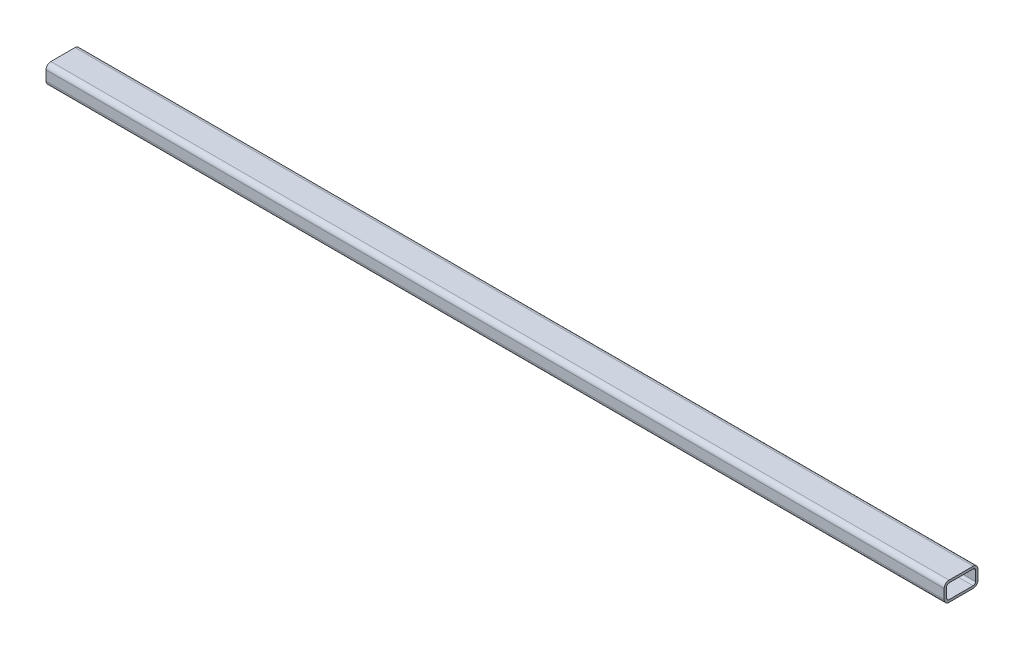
ISO-10303-21;
HEADER;
FILE_DESCRIPTION(('STEP AP214'),'2;1');
FILE_NAME('part.step','',(''),(''),'','','');
FILE_SCHEMA(('AUTOMOTIVE_DESIGN { 1 0 10303 214 1 1 1 1 }'));
ENDSEC;
DATA;
#1=APPLICATION_CONTEXT('core data for automotive mechanical design processes');
#2=APPLICATION_PROTOCOL_DEFINITION('international standard','automotive_design',2000,#1);
#3=PRODUCT_CONTEXT('',#1,'mechanical');
#4=PRODUCT('Part','Part','',(#3));
#5=PRODUCT_RELATED_PRODUCT_CATEGORY('part','',(#4));
#6=PRODUCT_DEFINITION_FORMATION('','',#4);
#7=PRODUCT_DEFINITION_CONTEXT('part definition',#1,'design');
#8=PRODUCT_DEFINITION('design','',#6,#7);
#9=PRODUCT_DEFINITION_SHAPE('','',#8);
#10=(LENGTH_UNIT() NAMED_UNIT(*) SI_UNIT(.MILLI.,.METRE.));
#11=(NAMED_UNIT(*) PLANE_ANGLE_UNIT() SI_UNIT($,.RADIAN.));
#12=(NAMED_UNIT(*) SI_UNIT($,.STERADIAN.) SOLID_ANGLE_UNIT());
#13=UNCERTAINTY_MEASURE_WITH_UNIT(LENGTH_MEASURE(1.E-05),#10,'distance_accuracy_value','');
#14=(GEOMETRIC_REPRESENTATION_CONTEXT(3) GLOBAL_UNCERTAINTY_ASSIGNED_CONTEXT((#13)) GLOBAL_UNIT_ASSIGNED_CONTEXT((#10,
#11,#12)) REPRESENTATION_CONTEXT('',''));
#15=CARTESIAN_POINT('',(0.,0.,0.));
#16=DIRECTION('',(0.,0.,1.));
#17=DIRECTION('',(1.,0.,0.));
#18=AXIS2_PLACEMENT_3D('',#15,#16,#17);
#19=CARTESIAN_POINT('',(930.,5.,-12.5));
#20=DIRECTION('',(1.,0.,0.));
#21=DIRECTION('',(0.,0.,-1.));
#22=AXIS2_PLACEMENT_3D('',#19,#20,#21);
#23=PLANE('',#22);
#24=CARTESIAN_POINT('',(930.,5.,-12.5));
#25=DIRECTION('',(1.,0.,0.));
#26=DIRECTION('',(0.,0.,-1.));
#27=AXIS2_PLACEMENT_3D('',#24,#25,#26);
#28=CIRCLE('',#27,5.);
#29=CARTESIAN_POINT('',(930.,5.,-17.5));
#30=VERTEX_POINT('',#29);
#31=CARTESIAN_POINT('',(930.,10.,-12.5));
#32=VERTEX_POINT('',#31);
#33=EDGE_CURVE('E224',#30,#32,#28,.T.);
#34=ORIENTED_EDGE('',*,*,#33,.T.);
#35=DIRECTION('',(0.,0.,1.));
#36=VECTOR('',#35,1.);
#37=CARTESIAN_POINT('',(930.,10.,12.5));
#38=LINE('',#37,#36);
#39=CARTESIAN_POINT('',(930.,10.,12.5));
#40=VERTEX_POINT('',#39);
#41=EDGE_CURVE('E227',#32,#40,#38,.T.);
#42=ORIENTED_EDGE('',*,*,#41,.T.);
#43=CARTESIAN_POINT('',(930.,5.,12.5));
#44=DIRECTION('',(1.,0.,0.));
#45=DIRECTION('',(0.,0.,1.));
#46=AXIS2_PLACEMENT_3D('',#43,#44,#45);
#47=CIRCLE('',#46,5.);
#48=CARTESIAN_POINT('',(930.,5.,17.5));
#49=VERTEX_POINT('',#48);
#50=EDGE_CURVE('E229',#40,#49,#47,.T.);
#51=ORIENTED_EDGE('',*,*,#50,.T.);
#52=DIRECTION('',(0.,-1.,0.));
#53=VECTOR('',#52,1.);
#54=CARTESIAN_POINT('',(930.,5.,17.5));
#55=LINE('',#54,#53);
#56=CARTESIAN_POINT('',(930.,-5.,17.5));
#57=VERTEX_POINT('',#56);
#58=EDGE_CURVE('E231',#49,#57,#55,.T.);
#59=ORIENTED_EDGE('',*,*,#58,.T.);
#60=CARTESIAN_POINT('',(930.,-5.,12.5));
#61=DIRECTION('',(1.,0.,0.));
#62=DIRECTION('',(0.,0.,1.));
#63=AXIS2_PLACEMENT_3D('',#60,#61,#62);
#64=CIRCLE('',#63,5.);
#65=CARTESIAN_POINT('',(930.,-10.,12.5));
#66=VERTEX_POINT('',#65);
#67=EDGE_CURVE('E233',#57,#66,#64,.T.);
#68=ORIENTED_EDGE('',*,*,#67,.T.);
#69=DIRECTION('',(0.,0.,-1.));
#70=VECTOR('',#69,1.);
#71=CARTESIAN_POINT('',(930.,-10.,12.5));
#72=LINE('',#71,#70);
#73=CARTESIAN_POINT('',(930.,-10.,-12.5));
#74=VERTEX_POINT('',#73);
#75=EDGE_CURVE('E235',#66,#74,#72,.T.);
#76=ORIENTED_EDGE('',*,*,#75,.T.);
#77=CARTESIAN_POINT('',(930.,-5.,-12.5));
#78=DIRECTION('',(1.,0.,0.));
#79=DIRECTION('',(0.,0.,1.));
#80=AXIS2_PLACEMENT_3D('',#77,#78,#79);
#81=CIRCLE('',#80,5.);
#82=CARTESIAN_POINT('',(930.,-5.,-17.5));
#83=VERTEX_POINT('',#82);
#84=EDGE_CURVE('E237',#74,#83,#81,.T.);
#85=ORIENTED_EDGE('',*,*,#84,.T.);
#86=DIRECTION('',(0.,1.,0.));
#87=VECTOR('',#86,1.);
#88=CARTESIAN_POINT('',(930.,5.,-17.5));
#89=LINE('',#88,#87);
#90=EDGE_CURVE('E239',#83,#30,#89,.T.);
#91=ORIENTED_EDGE('',*,*,#90,.T.);
#92=EDGE_LOOP('',(#34,#42,#51,#59,#68,#76,#85,#91));
#93=FACE_BOUND('',#92,.T.);
#94=DIRECTION('',(0.,-1.,0.));
#95=VECTOR('',#94,1.);
#96=CARTESIAN_POINT('',(930.,5.,15.));
#97=LINE('',#96,#95);
#98=CARTESIAN_POINT('',(930.,5.,15.));
#99=VERTEX_POINT('',#98);
#100=CARTESIAN_POINT('',(930.,-5.,15.));
#101=VERTEX_POINT('',#100);
#102=EDGE_CURVE('E182',#99,#101,#97,.T.);
#103=ORIENTED_EDGE('',*,*,#102,.F.);
#104=CARTESIAN_POINT('',(930.,5.,12.5));
#105=DIRECTION('',(1.,0.,0.));
#106=DIRECTION('',(0.,0.,1.));
#107=AXIS2_PLACEMENT_3D('',#104,#105,#106);
#108=CIRCLE('',#107,2.5);
#109=CARTESIAN_POINT('',(930.,7.5,12.5));
#110=VERTEX_POINT('',#109);
#111=EDGE_CURVE('E159',#110,#99,#108,.T.);
#112=ORIENTED_EDGE('',*,*,#111,.F.);
#113=DIRECTION('',(0.,0.,1.));
#114=VECTOR('',#113,1.);
#115=CARTESIAN_POINT('',(930.,7.5,12.5));
#116=LINE('',#115,#114);
#117=CARTESIAN_POINT('',(930.,7.5,-12.5));
#118=VERTEX_POINT('',#117);
#119=EDGE_CURVE('E194',#118,#110,#116,.T.);
#120=ORIENTED_EDGE('',*,*,#119,.F.);
#121=CARTESIAN_POINT('',(930.,5.,-12.5));
#122=DIRECTION('',(1.,0.,0.));
#123=DIRECTION('',(0.,0.,-1.));
#124=AXIS2_PLACEMENT_3D('',#121,#122,#123);
#125=CIRCLE('',#124,2.5);
#126=CARTESIAN_POINT('',(930.,5.,-15.));
#127=VERTEX_POINT('',#126);
#128=EDGE_CURVE('E192',#127,#118,#125,.T.);
#129=ORIENTED_EDGE('',*,*,#128,.F.);
#130=DIRECTION('',(0.,1.,0.));
#131=VECTOR('',#130,1.);
#132=CARTESIAN_POINT('',(930.,5.,-15.));
#133=LINE('',#132,#131);
#134=CARTESIAN_POINT('',(930.,-5.,-15.));
#135=VERTEX_POINT('',#134);
#136=EDGE_CURVE('E190',#135,#127,#133,.T.);
#137=ORIENTED_EDGE('',*,*,#136,.F.);
#138=CARTESIAN_POINT('',(930.,-5.,-12.5));
#139=DIRECTION('',(1.,0.,0.));
#140=DIRECTION('',(0.,0.,1.));
#141=AXIS2_PLACEMENT_3D('',#138,#139,#140);
#142=CIRCLE('',#141,2.5);
#143=CARTESIAN_POINT('',(930.,-7.5,-12.5));
#144=VERTEX_POINT('',#143);
#145=EDGE_CURVE('E188',#144,#135,#142,.T.);
#146=ORIENTED_EDGE('',*,*,#145,.F.);
#147=DIRECTION('',(0.,0.,-1.));
#148=VECTOR('',#147,1.);
#149=CARTESIAN_POINT('',(930.,-7.5,12.5));
#150=LINE('',#149,#148);
#151=CARTESIAN_POINT('',(930.,-7.5,12.5));
#152=VERTEX_POINT('',#151);
#153=EDGE_CURVE('E186',#152,#144,#150,.T.);
#154=ORIENTED_EDGE('',*,*,#153,.F.);
#155=CARTESIAN_POINT('',(930.,-5.,12.5));
#156=DIRECTION('',(1.,0.,0.));
#157=DIRECTION('',(0.,0.,1.));
#158=AXIS2_PLACEMENT_3D('',#155,#156,#157);
#159=CIRCLE('',#158,2.5);
#160=EDGE_CURVE('E184',#101,#152,#159,.T.);
#161=ORIENTED_EDGE('',*,*,#160,.F.);
#162=EDGE_LOOP('',(#103,#112,#120,#129,#137,#146,#154,#161));
#163=FACE_BOUND('',#162,.T.);
#164=ADVANCED_FACE('F31',(#93,#163),#23,.T.);
#165=CARTESIAN_POINT('',(0.,5.,-12.5));
#166=DIRECTION('',(1.,0.,0.));
#167=DIRECTION('',(0.,0.,-1.));
#168=AXIS2_PLACEMENT_3D('',#165,#166,#167);
#169=PLANE('',#168);
#170=CARTESIAN_POINT('',(0.,5.,-12.5));
#171=DIRECTION('',(1.,0.,0.));
#172=DIRECTION('',(0.,0.,-1.));
#173=AXIS2_PLACEMENT_3D('',#170,#171,#172);
#174=CIRCLE('',#173,5.);
#175=CARTESIAN_POINT('',(0.,5.,-17.5));
#176=VERTEX_POINT('',#175);
#177=CARTESIAN_POINT('',(0.,10.,-12.5));
#178=VERTEX_POINT('',#177);
#179=EDGE_CURVE('E160',#176,#178,#174,.T.);
#180=ORIENTED_EDGE('',*,*,#179,.F.);
#181=DIRECTION('',(0.,1.,0.));
#182=VECTOR('',#181,1.);
#183=CARTESIAN_POINT('',(0.,5.,-17.5));
#184=LINE('',#183,#182);
#185=CARTESIAN_POINT('',(0.,-5.,-17.5));
#186=VERTEX_POINT('',#185);
#187=EDGE_CURVE('E222',#186,#176,#184,.T.);
#188=ORIENTED_EDGE('',*,*,#187,.F.);
#189=CARTESIAN_POINT('',(0.,-5.,-12.5));
#190=DIRECTION('',(1.,0.,0.));
#191=DIRECTION('',(0.,0.,1.));
#192=AXIS2_PLACEMENT_3D('',#189,#190,#191);
#193=CIRCLE('',#192,5.);
#194=CARTESIAN_POINT('',(0.,-10.,-12.5));
#195=VERTEX_POINT('',#194);
#196=EDGE_CURVE('E220',#195,#186,#193,.T.);
#197=ORIENTED_EDGE('',*,*,#196,.F.);
#198=DIRECTION('',(0.,0.,-1.));
#199=VECTOR('',#198,1.);
#200=CARTESIAN_POINT('',(0.,-10.,12.5));
#201=LINE('',#200,#199);
#202=CARTESIAN_POINT('',(0.,-10.,12.5));
#203=VERTEX_POINT('',#202);
#204=EDGE_CURVE('E218',#203,#195,#201,.T.);
#205=ORIENTED_EDGE('',*,*,#204,.F.);
#206=CARTESIAN_POINT('',(0.,-5.,12.5));
#207=DIRECTION('',(1.,0.,0.));
#208=DIRECTION('',(0.,0.,1.));
#209=AXIS2_PLACEMENT_3D('',#206,#207,#208);
#210=CIRCLE('',#209,5.);
#211=CARTESIAN_POINT('',(0.,-5.,17.5));
#212=VERTEX_POINT('',#211);
#213=EDGE_CURVE('E216',#212,#203,#210,.T.);
#214=ORIENTED_EDGE('',*,*,#213,.F.);
#215=DIRECTION('',(0.,-1.,0.));
#216=VECTOR('',#215,1.);
#217=CARTESIAN_POINT('',(0.,5.,17.5));
#218=LINE('',#217,#216);
#219=CARTESIAN_POINT('',(0.,5.,17.5));
#220=VERTEX_POINT('',#219);
#221=EDGE_CURVE('E214',#220,#212,#218,.T.);
#222=ORIENTED_EDGE('',*,*,#221,.F.);
#223=CARTESIAN_POINT('',(0.,5.,12.5));
#224=DIRECTION('',(1.,0.,0.));
#225=DIRECTION('',(0.,0.,1.));
#226=AXIS2_PLACEMENT_3D('',#223,#224,#225);
#227=CIRCLE('',#226,5.);
#228=CARTESIAN_POINT('',(0.,10.,12.5));
#229=VERTEX_POINT('',#228);
#230=EDGE_CURVE('E212',#229,#220,#227,.T.);
#231=ORIENTED_EDGE('',*,*,#230,.F.);
#232=DIRECTION('',(0.,0.,1.));
#233=VECTOR('',#232,1.);
#234=CARTESIAN_POINT('',(0.,10.,12.5));
#235=LINE('',#234,#233);
#236=EDGE_CURVE('E210',#178,#229,#235,.T.);
#237=ORIENTED_EDGE('',*,*,#236,.F.);
#238=EDGE_LOOP('',(#180,#188,#197,#205,#214,#222,#231,#237));
#239=FACE_BOUND('',#238,.T.);
#240=CARTESIAN_POINT('',(0.,5.,12.5));
#241=DIRECTION('',(1.,0.,0.));
#242=DIRECTION('',(0.,0.,1.));
#243=AXIS2_PLACEMENT_3D('',#240,#241,#242);
#244=CIRCLE('',#243,2.5);
#245=CARTESIAN_POINT('',(0.,7.5,12.5));
#246=VERTEX_POINT('',#245);
#247=CARTESIAN_POINT('',(0.,5.,15.));
#248=VERTEX_POINT('',#247);
#249=EDGE_CURVE('E54',#246,#248,#244,.T.);
#250=ORIENTED_EDGE('',*,*,#249,.T.);
#251=DIRECTION('',(0.,-1.,0.));
#252=VECTOR('',#251,1.);
#253=CARTESIAN_POINT('',(0.,5.,15.));
#254=LINE('',#253,#252);
#255=CARTESIAN_POINT('',(0.,-5.,15.));
#256=VERTEX_POINT('',#255);
#257=EDGE_CURVE('E146',#248,#256,#254,.T.);
#258=ORIENTED_EDGE('',*,*,#257,.T.);
#259=CARTESIAN_POINT('',(0.,-5.,12.5));
#260=DIRECTION('',(1.,0.,0.));
#261=DIRECTION('',(0.,0.,1.));
#262=AXIS2_PLACEMENT_3D('',#259,#260,#261);
#263=CIRCLE('',#262,2.5);
#264=CARTESIAN_POINT('',(0.,-7.5,12.5));
#265=VERTEX_POINT('',#264);
#266=EDGE_CURVE('E155',#256,#265,#263,.T.);
#267=ORIENTED_EDGE('',*,*,#266,.T.);
#268=DIRECTION('',(0.,0.,-1.));
#269=VECTOR('',#268,1.);
#270=CARTESIAN_POINT('',(0.,-7.5,12.5));
#271=LINE('',#270,#269);
#272=CARTESIAN_POINT('',(0.,-7.5,-12.5));
#273=VERTEX_POINT('',#272);
#274=EDGE_CURVE('E169',#265,#273,#271,.T.);
#275=ORIENTED_EDGE('',*,*,#274,.T.);
#276=CARTESIAN_POINT('',(0.,-5.,-12.5));
#277=DIRECTION('',(1.,0.,0.));
#278=DIRECTION('',(0.,0.,1.));
#279=AXIS2_PLACEMENT_3D('',#276,#277,#278);
#280=CIRCLE('',#279,2.5);
#281=CARTESIAN_POINT('',(0.,-5.,-15.));
#282=VERTEX_POINT('',#281);
#283=EDGE_CURVE('E172',#273,#282,#280,.T.);
#284=ORIENTED_EDGE('',*,*,#283,.T.);
#285=DIRECTION('',(0.,1.,0.));
#286=VECTOR('',#285,1.);
#287=CARTESIAN_POINT('',(0.,5.,-15.));
#288=LINE('',#287,#286);
#289=CARTESIAN_POINT('',(0.,5.,-15.));
#290=VERTEX_POINT('',#289);
#291=EDGE_CURVE('E175',#282,#290,#288,.T.);
#292=ORIENTED_EDGE('',*,*,#291,.T.);
#293=CARTESIAN_POINT('',(0.,5.,-12.5));
#294=DIRECTION('',(1.,0.,0.));
#295=DIRECTION('',(0.,0.,-1.));
#296=AXIS2_PLACEMENT_3D('',#293,#294,#295);
#297=CIRCLE('',#296,2.5);
#298=CARTESIAN_POINT('',(0.,7.5,-12.5));
#299=VERTEX_POINT('',#298);
#300=EDGE_CURVE('E178',#290,#299,#297,.T.);
#301=ORIENTED_EDGE('',*,*,#300,.T.);
#302=DIRECTION('',(0.,0.,1.));
#303=VECTOR('',#302,1.);
#304=CARTESIAN_POINT('',(0.,7.5,12.5));
#305=LINE('',#304,#303);
#306=EDGE_CURVE('E165',#299,#246,#305,.T.);
#307=ORIENTED_EDGE('',*,*,#306,.T.);
#308=EDGE_LOOP('',(#250,#258,#267,#275,#284,#292,#301,#307));
#309=FACE_BOUND('',#308,.T.);
#310=ADVANCED_FACE('F163',(#239,#309),#169,.F.);
#311=CARTESIAN_POINT('',(930.,5.,-12.5));
#312=DIRECTION('',(-1.,0.,0.));
#313=DIRECTION('',(0.,0.,1.));
#314=AXIS2_PLACEMENT_3D('',#311,#312,#313);
#315=CYLINDRICAL_SURFACE('',#314,5.);
#316=ORIENTED_EDGE('',*,*,#179,.T.);
#317=DIRECTION('',(-1.,0.,0.));
#318=VECTOR('',#317,1.);
#319=CARTESIAN_POINT('',(930.,10.,-12.5));
#320=LINE('',#319,#318);
#321=EDGE_CURVE('E11',#32,#178,#320,.T.);
#322=ORIENTED_EDGE('',*,*,#321,.F.);
#323=ORIENTED_EDGE('',*,*,#33,.F.);
#324=DIRECTION('',(-1.,0.,0.));
#325=VECTOR('',#324,1.);
#326=CARTESIAN_POINT('',(930.,5.,-17.5));
#327=LINE('',#326,#325);
#328=EDGE_CURVE('E241',#30,#176,#327,.T.);
#329=ORIENTED_EDGE('',*,*,#328,.T.);
#330=EDGE_LOOP('',(#316,#322,#323,#329));
#331=FACE_BOUND('',#330,.T.);
#332=ADVANCED_FACE('F33',(#331),#315,.T.);
#333=CARTESIAN_POINT('',(930.,10.,12.5));
#334=DIRECTION('',(0.,-1.,0.));
#335=DIRECTION('',(0.,0.,-1.));
#336=AXIS2_PLACEMENT_3D('',#333,#334,#335);
#337=PLANE('',#336);
#338=ORIENTED_EDGE('',*,*,#236,.T.);
#339=DIRECTION('',(-1.,0.,0.));
#340=VECTOR('',#339,1.);
#341=CARTESIAN_POINT('',(930.,10.,12.5));
#342=LINE('',#341,#340);
#343=EDGE_CURVE('E39',#40,#229,#342,.T.);
#344=ORIENTED_EDGE('',*,*,#343,.F.);
#345=ORIENTED_EDGE('',*,*,#41,.F.);
#346=ORIENTED_EDGE('',*,*,#321,.T.);
#347=EDGE_LOOP('',(#338,#344,#345,#346));
#348=FACE_BOUND('',#347,.T.);
#349=ADVANCED_FACE('F285',(#348),#337,.F.);
#350=CARTESIAN_POINT('',(930.,5.,12.5));
#351=DIRECTION('',(-1.,0.,0.));
#352=DIRECTION('',(0.,0.,1.));
#353=AXIS2_PLACEMENT_3D('',#350,#351,#352);
#354=CYLINDRICAL_SURFACE('',#353,5.);
#355=ORIENTED_EDGE('',*,*,#230,.T.);
#356=DIRECTION('',(-1.,0.,0.));
#357=VECTOR('',#356,1.);
#358=CARTESIAN_POINT('',(930.,5.,17.5));
#359=LINE('',#358,#357);
#360=EDGE_CURVE('E256',#49,#220,#359,.T.);
#361=ORIENTED_EDGE('',*,*,#360,.F.);
#362=ORIENTED_EDGE('',*,*,#50,.F.);
#363=ORIENTED_EDGE('',*,*,#343,.T.);
#364=EDGE_LOOP('',(#355,#361,#362,#363));
#365=FACE_BOUND('',#364,.T.);
#366=ADVANCED_FACE('F263',(#365),#354,.T.);
#367=CARTESIAN_POINT('',(930.,5.,17.5));
#368=DIRECTION('',(0.,0.,-1.));
#369=DIRECTION('',(-1.,0.,0.));
#370=AXIS2_PLACEMENT_3D('',#367,#368,#369);
#371=PLANE('',#370);
#372=ORIENTED_EDGE('',*,*,#221,.T.);
#373=DIRECTION('',(-1.,0.,0.));
#374=VECTOR('',#373,1.);
#375=CARTESIAN_POINT('',(930.,-5.,17.5));
#376=LINE('',#375,#374);
#377=EDGE_CURVE('E253',#57,#212,#376,.T.);
#378=ORIENTED_EDGE('',*,*,#377,.F.);
#379=ORIENTED_EDGE('',*,*,#58,.F.);
#380=ORIENTED_EDGE('',*,*,#360,.T.);
#381=EDGE_LOOP('',(#372,#378,#379,#380));
#382=FACE_BOUND('',#381,.T.);
#383=ADVANCED_FACE('F273',(#382),#371,.F.);
#384=CARTESIAN_POINT('',(930.,-5.,12.5));
#385=DIRECTION('',(-1.,0.,0.));
#386=DIRECTION('',(0.,0.,1.));
#387=AXIS2_PLACEMENT_3D('',#384,#385,#386);
#388=CYLINDRICAL_SURFACE('',#387,5.);
#389=ORIENTED_EDGE('',*,*,#213,.T.);
#390=DIRECTION('',(-1.,0.,0.));
#391=VECTOR('',#390,1.);
#392=CARTESIAN_POINT('',(930.,-10.,12.5));
#393=LINE('',#392,#391);
#394=EDGE_CURVE('E250',#66,#203,#393,.T.);
#395=ORIENTED_EDGE('',*,*,#394,.F.);
#396=ORIENTED_EDGE('',*,*,#67,.F.);
#397=ORIENTED_EDGE('',*,*,#377,.T.);
#398=EDGE_LOOP('',(#389,#395,#396,#397));
#399=FACE_BOUND('',#398,.T.);
#400=ADVANCED_FACE('F277',(#399),#388,.T.);
#401=CARTESIAN_POINT('',(930.,-10.,12.5));
#402=DIRECTION('',(0.,1.,0.));
#403=DIRECTION('',(0.,0.,1.));
#404=AXIS2_PLACEMENT_3D('',#401,#402,#403);
#405=PLANE('',#404);
#406=ORIENTED_EDGE('',*,*,#204,.T.);
#407=DIRECTION('',(-1.,0.,0.));
#408=VECTOR('',#407,1.);
#409=CARTESIAN_POINT('',(930.,-10.,-12.5));
#410=LINE('',#409,#408);
#411=EDGE_CURVE('E247',#74,#195,#410,.T.);
#412=ORIENTED_EDGE('',*,*,#411,.F.);
#413=ORIENTED_EDGE('',*,*,#75,.F.);
#414=ORIENTED_EDGE('',*,*,#394,.T.);
#415=EDGE_LOOP('',(#406,#412,#413,#414));
#416=FACE_BOUND('',#415,.T.);
#417=ADVANCED_FACE('F298',(#416),#405,.F.);
#418=CARTESIAN_POINT('',(930.,-5.,-12.5));
#419=DIRECTION('',(-1.,0.,0.));
#420=DIRECTION('',(0.,0.,1.));
#421=AXIS2_PLACEMENT_3D('',#418,#419,#420);
#422=CYLINDRICAL_SURFACE('',#421,5.);
#423=ORIENTED_EDGE('',*,*,#196,.T.);
#424=DIRECTION('',(-1.,0.,0.));
#425=VECTOR('',#424,1.);
#426=CARTESIAN_POINT('',(930.,-5.,-17.5));
#427=LINE('',#426,#425);
#428=EDGE_CURVE('E244',#83,#186,#427,.T.);
#429=ORIENTED_EDGE('',*,*,#428,.F.);
#430=ORIENTED_EDGE('',*,*,#84,.F.);
#431=ORIENTED_EDGE('',*,*,#411,.T.);
#432=EDGE_LOOP('',(#423,#429,#430,#431));
#433=FACE_BOUND('',#432,.T.);
#434=ADVANCED_FACE('F296',(#433),#422,.T.);
#435=CARTESIAN_POINT('',(930.,5.,-17.5));
#436=DIRECTION('',(0.,0.,1.));
#437=DIRECTION('',(1.,0.,0.));
#438=AXIS2_PLACEMENT_3D('',#435,#436,#437);
#439=PLANE('',#438);
#440=ORIENTED_EDGE('',*,*,#187,.T.);
#441=ORIENTED_EDGE('',*,*,#328,.F.);
#442=ORIENTED_EDGE('',*,*,#90,.F.);
#443=ORIENTED_EDGE('',*,*,#428,.T.);
#444=EDGE_LOOP('',(#440,#441,#442,#443));
#445=FACE_BOUND('',#444,.T.);
#446=ADVANCED_FACE('F291',(#445),#439,.F.);
#447=CARTESIAN_POINT('',(930.,5.,12.5));
#448=DIRECTION('',(-1.,0.,0.));
#449=DIRECTION('',(0.,0.,1.));
#450=AXIS2_PLACEMENT_3D('',#447,#448,#449);
#451=CYLINDRICAL_SURFACE('',#450,2.5);
#452=ORIENTED_EDGE('',*,*,#249,.F.);
#453=DIRECTION('',(-1.,0.,0.));
#454=VECTOR('',#453,1.);
#455=CARTESIAN_POINT('',(930.,7.5,12.5));
#456=LINE('',#455,#454);
#457=EDGE_CURVE('E196',#110,#246,#456,.T.);
#458=ORIENTED_EDGE('',*,*,#457,.F.);
#459=ORIENTED_EDGE('',*,*,#111,.T.);
#460=DIRECTION('',(-1.,0.,0.));
#461=VECTOR('',#460,1.);
#462=CARTESIAN_POINT('',(930.,5.,15.));
#463=LINE('',#462,#461);
#464=EDGE_CURVE('E148',#99,#248,#463,.T.);
#465=ORIENTED_EDGE('',*,*,#464,.T.);
#466=EDGE_LOOP('',(#452,#458,#459,#465));
#467=FACE_BOUND('',#466,.T.);
#468=ADVANCED_FACE('F157',(#467),#451,.F.);
#469=CARTESIAN_POINT('',(930.,5.,15.));
#470=DIRECTION('',(0.,0.,-1.));
#471=DIRECTION('',(-1.,0.,0.));
#472=AXIS2_PLACEMENT_3D('',#469,#470,#471);
#473=PLANE('',#472);
#474=ORIENTED_EDGE('',*,*,#257,.F.);
#475=ORIENTED_EDGE('',*,*,#464,.F.);
#476=ORIENTED_EDGE('',*,*,#102,.T.);
#477=DIRECTION('',(-1.,0.,0.));
#478=VECTOR('',#477,1.);
#479=CARTESIAN_POINT('',(930.,-5.,15.));
#480=LINE('',#479,#478);
#481=EDGE_CURVE('E151',#101,#256,#480,.T.);
#482=ORIENTED_EDGE('',*,*,#481,.T.);
#483=EDGE_LOOP('',(#474,#475,#476,#482));
#484=FACE_BOUND('',#483,.T.);
#485=ADVANCED_FACE('F147',(#484),#473,.T.);
#486=CARTESIAN_POINT('',(930.,-5.,12.5));
#487=DIRECTION('',(-1.,0.,0.));
#488=DIRECTION('',(0.,0.,1.));
#489=AXIS2_PLACEMENT_3D('',#486,#487,#488);
#490=CYLINDRICAL_SURFACE('',#489,2.5);
#491=ORIENTED_EDGE('',*,*,#266,.F.);
#492=ORIENTED_EDGE('',*,*,#481,.F.);
#493=ORIENTED_EDGE('',*,*,#160,.T.);
#494=DIRECTION('',(-1.,0.,0.));
#495=VECTOR('',#494,1.);
#496=CARTESIAN_POINT('',(930.,-7.5,12.5));
#497=LINE('',#496,#495);
#498=EDGE_CURVE('E205',#152,#265,#497,.T.);
#499=ORIENTED_EDGE('',*,*,#498,.T.);
#500=EDGE_LOOP('',(#491,#492,#493,#499));
#501=FACE_BOUND('',#500,.T.);
#502=ADVANCED_FACE('F322',(#501),#490,.F.);
#503=CARTESIAN_POINT('',(930.,-7.5,12.5));
#504=DIRECTION('',(0.,1.,0.));
#505=DIRECTION('',(0.,0.,1.));
#506=AXIS2_PLACEMENT_3D('',#503,#504,#505);
#507=PLANE('',#506);
#508=ORIENTED_EDGE('',*,*,#274,.F.);
#509=ORIENTED_EDGE('',*,*,#498,.F.);
#510=ORIENTED_EDGE('',*,*,#153,.T.);
#511=DIRECTION('',(-1.,0.,0.));
#512=VECTOR('',#511,1.);
#513=CARTESIAN_POINT('',(930.,-7.5,-12.5));
#514=LINE('',#513,#512);
#515=EDGE_CURVE('E203',#144,#273,#514,.T.);
#516=ORIENTED_EDGE('',*,*,#515,.T.);
#517=EDGE_LOOP('',(#508,#509,#510,#516));
#518=FACE_BOUND('',#517,.T.);
#519=ADVANCED_FACE('F327',(#518),#507,.T.);
#520=CARTESIAN_POINT('',(930.,-5.,-12.5));
#521=DIRECTION('',(-1.,0.,0.));
#522=DIRECTION('',(0.,0.,1.));
#523=AXIS2_PLACEMENT_3D('',#520,#521,#522);
#524=CYLINDRICAL_SURFACE('',#523,2.5);
#525=ORIENTED_EDGE('',*,*,#283,.F.);
#526=ORIENTED_EDGE('',*,*,#515,.F.);
#527=ORIENTED_EDGE('',*,*,#145,.T.);
#528=DIRECTION('',(-1.,0.,0.));
#529=VECTOR('',#528,1.);
#530=CARTESIAN_POINT('',(930.,-5.,-15.));
#531=LINE('',#530,#529);
#532=EDGE_CURVE('E201',#135,#282,#531,.T.);
#533=ORIENTED_EDGE('',*,*,#532,.T.);
#534=EDGE_LOOP('',(#525,#526,#527,#533));
#535=FACE_BOUND('',#534,.T.);
#536=ADVANCED_FACE('F331',(#535),#524,.F.);
#537=CARTESIAN_POINT('',(930.,5.,-15.));
#538=DIRECTION('',(0.,0.,1.));
#539=DIRECTION('',(1.,0.,0.));
#540=AXIS2_PLACEMENT_3D('',#537,#538,#539);
#541=PLANE('',#540);
#542=ORIENTED_EDGE('',*,*,#291,.F.);
#543=ORIENTED_EDGE('',*,*,#532,.F.);
#544=ORIENTED_EDGE('',*,*,#136,.T.);
#545=DIRECTION('',(-1.,0.,0.));
#546=VECTOR('',#545,1.);
#547=CARTESIAN_POINT('',(930.,5.,-15.));
#548=LINE('',#547,#546);
#549=EDGE_CURVE('E199',#127,#290,#548,.T.);
#550=ORIENTED_EDGE('',*,*,#549,.T.);
#551=EDGE_LOOP('',(#542,#543,#544,#550));
#552=FACE_BOUND('',#551,.T.);
#553=ADVANCED_FACE('F335',(#552),#541,.T.);
#554=CARTESIAN_POINT('',(930.,5.,-12.5));
#555=DIRECTION('',(-1.,0.,0.));
#556=DIRECTION('',(0.,0.,1.));
#557=AXIS2_PLACEMENT_3D('',#554,#555,#556);
#558=CYLINDRICAL_SURFACE('',#557,2.5);
#559=ORIENTED_EDGE('',*,*,#300,.F.);
#560=ORIENTED_EDGE('',*,*,#549,.F.);
#561=ORIENTED_EDGE('',*,*,#128,.T.);
#562=DIRECTION('',(-1.,0.,0.));
#563=VECTOR('',#562,1.);
#564=CARTESIAN_POINT('',(930.,7.5,-12.5));
#565=LINE('',#564,#563);
#566=EDGE_CURVE('E46',#118,#299,#565,.T.);
#567=ORIENTED_EDGE('',*,*,#566,.T.);
#568=EDGE_LOOP('',(#559,#560,#561,#567));
#569=FACE_BOUND('',#568,.T.);
#570=ADVANCED_FACE('F339',(#569),#558,.F.);
#571=CARTESIAN_POINT('',(930.,7.5,12.5));
#572=DIRECTION('',(0.,-1.,0.));
#573=DIRECTION('',(0.,0.,-1.));
#574=AXIS2_PLACEMENT_3D('',#571,#572,#573);
#575=PLANE('',#574);
#576=ORIENTED_EDGE('',*,*,#306,.F.);
#577=ORIENTED_EDGE('',*,*,#566,.F.);
#578=ORIENTED_EDGE('',*,*,#119,.T.);
#579=ORIENTED_EDGE('',*,*,#457,.T.);
#580=EDGE_LOOP('',(#576,#577,#578,#579));
#581=FACE_BOUND('',#580,.T.);
#582=ADVANCED_FACE('F343',(#581),#575,.T.);
#583=CLOSED_SHELL('',(#164,#310,#332,#349,#366,#383,#400,#417,#434,#446,#468,#485,#502,#519,
#536,#553,#570,#582));
#584=MANIFOLD_SOLID_BREP('B2',#583);
#585=ADVANCED_BREP_SHAPE_REPRESENTATION('',(#18,#584),#14);
#586=SHAPE_DEFINITION_REPRESENTATION(#9,#585);
ENDSEC;
END-ISO-10303-21;
